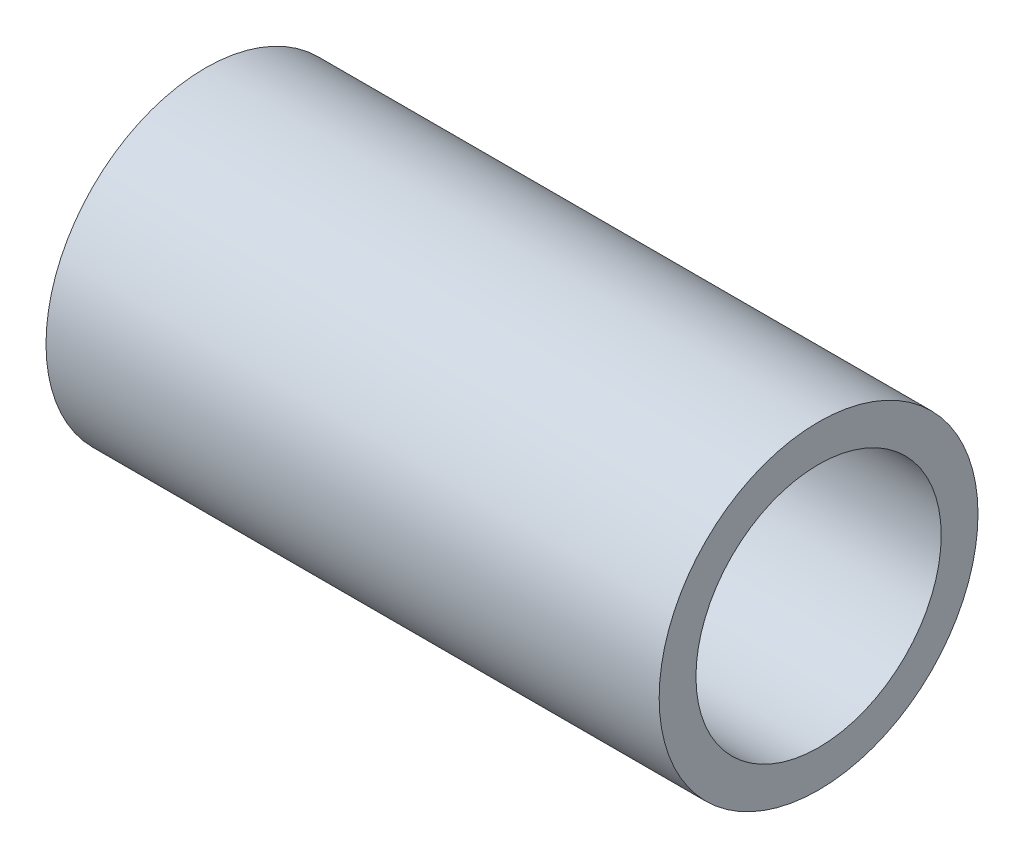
ISO-10303-21;
HEADER;
FILE_DESCRIPTION(('STEP AP214'),'2;1');
FILE_NAME('part.step','',(''),(''),'','','');
FILE_SCHEMA(('AUTOMOTIVE_DESIGN { 1 0 10303 214 1 1 1 1 }'));
ENDSEC;
DATA;
#1=APPLICATION_CONTEXT('core data for automotive mechanical design processes');
#2=APPLICATION_PROTOCOL_DEFINITION('international standard','automotive_design',2000,#1);
#3=PRODUCT_CONTEXT('',#1,'mechanical');
#4=PRODUCT('Part','Part','',(#3));
#5=PRODUCT_RELATED_PRODUCT_CATEGORY('part','',(#4));
#6=PRODUCT_DEFINITION_FORMATION('','',#4);
#7=PRODUCT_DEFINITION_CONTEXT('part definition',#1,'design');
#8=PRODUCT_DEFINITION('design','',#6,#7);
#9=PRODUCT_DEFINITION_SHAPE('','',#8);
#10=(LENGTH_UNIT() NAMED_UNIT(*) SI_UNIT(.MILLI.,.METRE.));
#11=(NAMED_UNIT(*) PLANE_ANGLE_UNIT() SI_UNIT($,.RADIAN.));
#12=(NAMED_UNIT(*) SI_UNIT($,.STERADIAN.) SOLID_ANGLE_UNIT());
#13=UNCERTAINTY_MEASURE_WITH_UNIT(LENGTH_MEASURE(1.E-05),#10,'distance_accuracy_value','');
#14=(GEOMETRIC_REPRESENTATION_CONTEXT(3) GLOBAL_UNCERTAINTY_ASSIGNED_CONTEXT((#13)) GLOBAL_UNIT_ASSIGNED_CONTEXT((#10,
#11,#12)) REPRESENTATION_CONTEXT('',''));
#15=CARTESIAN_POINT('',(0.,0.,0.));
#16=DIRECTION('',(0.,0.,1.));
#17=DIRECTION('',(1.,0.,0.));
#18=AXIS2_PLACEMENT_3D('',#15,#16,#17);
#19=CARTESIAN_POINT('',(63.5,0.,0.));
#20=DIRECTION('',(-1.,0.,0.));
#21=DIRECTION('',(0.,0.,1.));
#22=AXIS2_PLACEMENT_3D('',#19,#20,#21);
#23=CYLINDRICAL_SURFACE('',#22,12.7);
#24=CARTESIAN_POINT('',(63.5,0.,0.));
#25=DIRECTION('',(1.,0.,0.));
#26=DIRECTION('',(0.,0.,-1.));
#27=AXIS2_PLACEMENT_3D('',#24,#25,#26);
#28=CIRCLE('',#27,12.7);
#29=CARTESIAN_POINT('',(63.5,0.,-12.7));
#30=VERTEX_POINT('',#29);
#31=EDGE_CURVE('E53',#30,#30,#28,.T.);
#32=ORIENTED_EDGE('',*,*,#31,.T.);
#33=EDGE_LOOP('',(#32));
#34=FACE_BOUND('',#33,.T.);
#35=CARTESIAN_POINT('',(0.,0.,0.));
#36=DIRECTION('',(1.,0.,0.));
#37=DIRECTION('',(0.,0.,-1.));
#38=AXIS2_PLACEMENT_3D('',#35,#36,#37);
#39=CIRCLE('',#38,12.7);
#40=CARTESIAN_POINT('',(0.,0.,-12.7));
#41=VERTEX_POINT('',#40);
#42=EDGE_CURVE('E60',#41,#41,#39,.T.);
#43=ORIENTED_EDGE('',*,*,#42,.F.);
#44=EDGE_LOOP('',(#43));
#45=FACE_BOUND('',#44,.T.);
#46=ADVANCED_FACE('F45',(#34,#45),#23,.F.);
#47=CARTESIAN_POINT('',(63.5,0.,0.));
#48=DIRECTION('',(-1.,0.,0.));
#49=DIRECTION('',(0.,0.,1.));
#50=AXIS2_PLACEMENT_3D('',#47,#48,#49);
#51=CYLINDRICAL_SURFACE('',#50,16.51);
#52=CARTESIAN_POINT('',(63.5,0.,0.));
#53=DIRECTION('',(1.,0.,0.));
#54=DIRECTION('',(0.,0.,-1.));
#55=AXIS2_PLACEMENT_3D('',#52,#53,#54);
#56=CIRCLE('',#55,16.51);
#57=CARTESIAN_POINT('',(63.5,0.,-16.51));
#58=VERTEX_POINT('',#57);
#59=EDGE_CURVE('E10',#58,#58,#56,.T.);
#60=ORIENTED_EDGE('',*,*,#59,.F.);
#61=EDGE_LOOP('',(#60));
#62=FACE_BOUND('',#61,.T.);
#63=CARTESIAN_POINT('',(0.,0.,0.));
#64=DIRECTION('',(1.,0.,0.));
#65=DIRECTION('',(0.,0.,-1.));
#66=AXIS2_PLACEMENT_3D('',#63,#64,#65);
#67=CIRCLE('',#66,16.51);
#68=CARTESIAN_POINT('',(0.,0.,-16.51));
#69=VERTEX_POINT('',#68);
#70=EDGE_CURVE('E48',#69,#69,#67,.T.);
#71=ORIENTED_EDGE('',*,*,#70,.T.);
#72=EDGE_LOOP('',(#71));
#73=FACE_BOUND('',#72,.T.);
#74=ADVANCED_FACE('F69',(#62,#73),#51,.T.);
#75=CARTESIAN_POINT('',(63.5,0.,0.));
#76=DIRECTION('',(1.,0.,0.));
#77=DIRECTION('',(0.,0.,-1.));
#78=AXIS2_PLACEMENT_3D('',#75,#76,#77);
#79=PLANE('',#78);
#80=ORIENTED_EDGE('',*,*,#31,.F.);
#81=EDGE_LOOP('',(#80));
#82=FACE_BOUND('',#81,.T.);
#83=ORIENTED_EDGE('',*,*,#59,.T.);
#84=EDGE_LOOP('',(#83));
#85=FACE_BOUND('',#84,.T.);
#86=ADVANCED_FACE('F73',(#82,#85),#79,.T.);
#87=CARTESIAN_POINT('',(0.,0.,0.));
#88=DIRECTION('',(1.,0.,0.));
#89=DIRECTION('',(0.,0.,-1.));
#90=AXIS2_PLACEMENT_3D('',#87,#88,#89);
#91=PLANE('',#90);
#92=ORIENTED_EDGE('',*,*,#42,.T.);
#93=EDGE_LOOP('',(#92));
#94=FACE_BOUND('',#93,.T.);
#95=ORIENTED_EDGE('',*,*,#70,.F.);
#96=EDGE_LOOP('',(#95));
#97=FACE_BOUND('',#96,.T.);
#98=ADVANCED_FACE('F71',(#94,#97),#91,.F.);
#99=CLOSED_SHELL('',(#46,#74,#86,#98));
#100=MANIFOLD_SOLID_BREP('B2',#99);
#101=ADVANCED_BREP_SHAPE_REPRESENTATION('',(#18,#100),#14);
#102=SHAPE_DEFINITION_REPRESENTATION(#9,#101);
ENDSEC;
END-ISO-10303-21;
